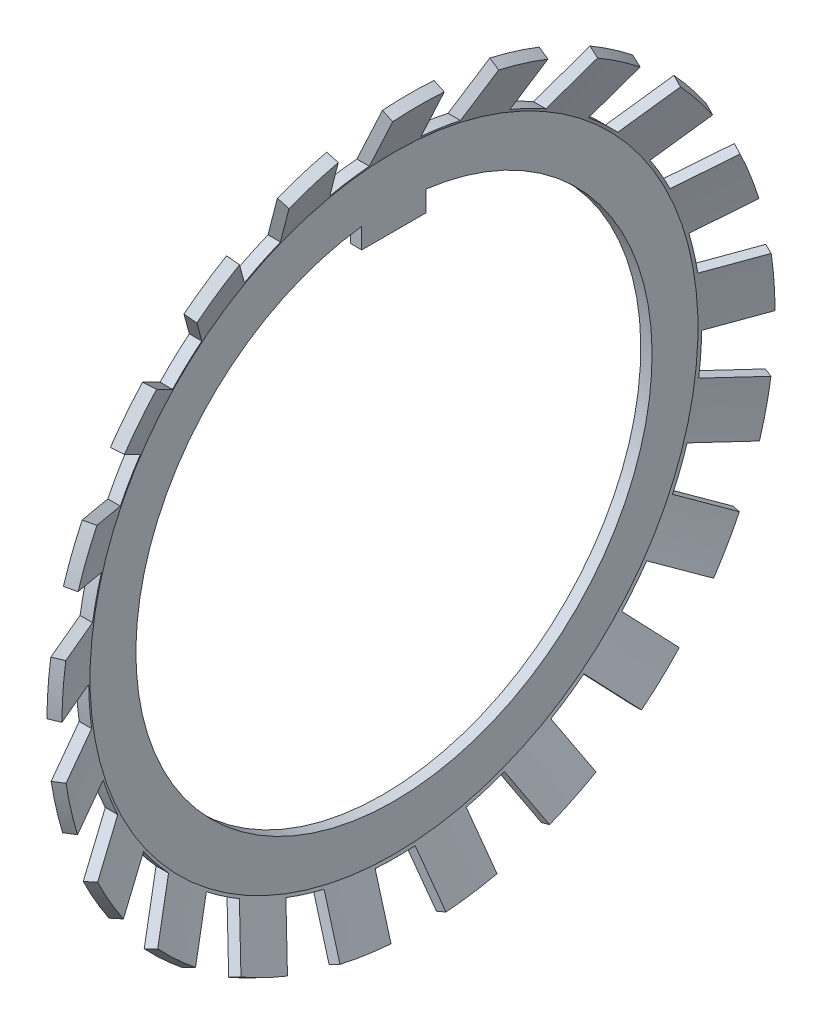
from build123d import *

# Parameters (mm, degrees)
ENL_V_MAT_EXTRU_1_DEPTH = 1.75
ESQUISSE3_W             = 246.4
ESQUISSE3_H             = 246.4
ENL_V_MAT_EXTRU_2_DEPTH = 76.5


with BuildPart() as part:
    # Esquisse1 → R_volution1 (revolve)
    with BuildSketch(Plane.XY, mode=Mode.PRIVATE) as r_volution1_sk:
        Polygon((0, 0), (0, 47.5), (3.963615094, 56), (5.549653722, 55.260418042), (1.75, 47.11203434), (1.75, 0), align=None)
    revolve(r_volution1_sk.sketch.rotate(Axis((1.75, 0, 0), (-1, 0, 0)), 180), axis=Axis((1.75, 0, 0), (-1, 0, 0)))

    # Esquisse2 → Enl_v. mat.-Extru.1 (cut)
    with BuildSketch(Plane(origin=(0, 0, 0), x_dir=(0, 0, -1), z_dir=(1, 0, 0))):
        with BuildLine():
            Line((5, 39.686269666), (5, 36.5))
            Line((5, 36.5), (-5, 36.5))
            Line((-5, 36.5), (-5, 39.686269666))
            ThreePointArc((-5, 39.686269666), (0, -40), (5, 39.686269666))
        make_face()
    extrude(amount=ENL_V_MAT_EXTRU_1_DEPTH, mode=Mode.SUBTRACT)

    # Esquisse3 → Enl_v. mat.-Extru.2 (cut)
    with BuildSketch(Plane(origin=(0, 0, 0), x_dir=(0, 0, -1), z_dir=(1, 0, 0))):
        Rectangle(ESQUISSE3_W, ESQUISSE3_H)
        with BuildLine():
            Line((-55.99969316, 0.185380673), (-47.497851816, -0.451744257))
            ThreePointArc((-47.497851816, -0.451744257), (-47.367180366, -3.549679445), (-47.034669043, -6.632488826))
            Line((-47.034669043, -6.632488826), (-55.3465933, -8.529631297))
            ThreePointArc((-55.3465933, -8.529631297), (-54.595963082, -12.461172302), (-53.566425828, -16.329054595))
            Line((-53.566425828, -16.329054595), (-45.254501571, -14.431912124))
            ThreePointArc((-45.254501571, -14.431912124), (-44.216503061, -17.353698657), (-42.990090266, -20.201538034))
            Line((-42.990090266, -20.201538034), (-50.37354649, -24.464378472))
            ThreePointArc((-50.37354649, -24.464378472), (-48.497422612, -28), (-46.37354649, -31.392581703))
            Line((-46.37354649, -31.392581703), (-38.990090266, -27.129741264))
            ThreePointArc((-38.990090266, -27.129741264), (-37.136995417, -29.615765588), (-35.12565331, -31.975591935))
            Line((-35.12565331, -31.975591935), (-40.924589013, -38.22535826))
            ThreePointArc((-40.924589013, -38.22535826), (-38.089673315, -41.050904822), (-35.060174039, -43.666740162))
            Line((-35.060174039, -43.666740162), (-29.261238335, -37.416973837))
            ThreePointArc((-29.261238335, -37.416973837), (-26.757702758, -39.24634178), (-24.140147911, -40.908474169))
            Line((-24.140147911, -40.908474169), (-27.839302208, -48.589847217))
            ThreePointArc((-27.839302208, -48.589847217), (-24.297489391, -50.454256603), (-20.631551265, -52.06091713))
            Line((-20.631551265, -52.06091713), (-16.932396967, -44.379544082))
            ThreePointArc((-16.932396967, -44.379544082), (-14.000870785, -45.389708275), (-11.009684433, -46.20645895))
            Line((-11.009684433, -46.20645895), (-12.280371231, -54.636915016))
            ThreePointArc((-12.280371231, -54.636915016), (-8.346366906, -55.374526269), (-4.369724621, -55.829253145))
            Line((-4.369724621, -55.829253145), (-3.099037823, -47.398797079))
            ThreePointArc((-3.099037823, -47.398797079), (0, -47.5), (3.099037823, -47.398797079))
            Line((3.099037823, -47.398797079), (4.369724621, -55.829253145))
            ThreePointArc((4.369724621, -55.829253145), (8.346366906, -55.374526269), (12.280371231, -54.636915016))
            Line((12.280371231, -54.636915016), (11.009684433, -46.20645895))
            ThreePointArc((11.009684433, -46.20645895), (14.000870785, -45.389708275), (16.932396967, -44.379544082))
            Line((16.932396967, -44.379544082), (20.631551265, -52.06091713))
            ThreePointArc((20.631551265, -52.06091713), (24.297489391, -50.454256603), (27.839302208, -48.589847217))
            Line((27.839302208, -48.589847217), (24.140147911, -40.908474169))
            ThreePointArc((24.140147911, -40.908474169), (26.757702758, -39.24634178), (29.261238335, -37.416973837))
            Line((29.261238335, -37.416973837), (35.060174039, -43.666740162))
            ThreePointArc((35.060174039, -43.666740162), (38.089673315, -41.050904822), (40.924589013, -38.22535826))
            Line((40.924589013, -38.22535826), (35.12565331, -31.975591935))
            ThreePointArc((35.12565331, -31.975591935), (37.136995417, -29.615765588), (38.990090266, -27.129741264))
            Line((38.990090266, -27.129741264), (46.37354649, -31.392581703))
            ThreePointArc((46.37354649, -31.392581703), (48.497422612, -28), (50.37354649, -24.464378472))
            Line((50.37354649, -24.464378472), (42.990090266, -20.201538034))
            ThreePointArc((42.990090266, -20.201538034), (44.216503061, -17.353698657), (45.254501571, -14.431912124))
            Line((45.254501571, -14.431912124), (53.566425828, -16.329054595))
            ThreePointArc((53.566425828, -16.329054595), (54.595963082, -12.461172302), (55.3465933, -8.529631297))
            Line((55.3465933, -8.529631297), (47.034669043, -6.632488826))
            ThreePointArc((47.034669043, -6.632488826), (47.367180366, -3.549679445), (47.497851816, -0.451744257))
            Line((47.497851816, -0.451744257), (55.99969316, 0.185380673))
            ThreePointArc((55.99969316, 0.185380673), (55.843412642, 4.184885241), (55.401852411, 8.16301105))
            Line((55.401852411, 8.16301105), (46.900011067, 7.52588612))
            ThreePointArc((46.900011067, 7.52588612), (46.309075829, 10.569744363), (45.520809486, 13.568563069))
            Line((45.520809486, 13.568563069), (53.457142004, 16.683344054))
            ThreePointArc((53.457142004, 16.683344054), (52.128929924, 20.459097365), (50.534413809, 24.130334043))
            Line((50.534413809, 24.130334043), (42.598081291, 21.015553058))
            ThreePointArc((42.598081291, 21.015553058), (41.13620668, 23.75), (39.499043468, 26.383244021))
            Line((39.499043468, 26.383244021), (46.164689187, 31.698919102))
            ThreePointArc((46.164689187, 31.698919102), (43.782563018, 34.915428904), (41.176770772, 37.953570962))
            Line((41.176770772, 37.953570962), (34.511125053, 32.637895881))
            ThreePointArc((34.511125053, 32.637895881), (32.308205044, 34.819963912), (29.9676141, 36.853657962))
            Line((29.9676141, 36.853657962), (34.770301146, 43.89790608))
            ThreePointArc((34.770301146, 43.89790608), (31.545923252, 46.269371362), (28.160390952, 48.404466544))
            Line((28.160390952, 48.404466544), (23.357703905, 41.360218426))
            ThreePointArc((23.357703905, 41.360218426), (20.609477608, 42.796021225), (17.773430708, 44.049462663))
            Line((17.773430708, 44.049462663), (20.286419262, 52.19637146))
            ThreePointArc((20.286419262, 52.19637146), (16.506289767, 53.512077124), (12.641836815, 54.554412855))
            Line((12.641836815, 54.554412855), (10.128848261, 46.407504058))
            ThreePointArc((10.128848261, 46.407504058), (7.079507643, 46.969464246), (4, 47.331279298))
            Line((4, 47.331279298), (4, 55.856960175))
            ThreePointArc((4, 55.856960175), (0, 56), (-4, 55.856960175))
            Line((-4, 55.856960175), (-4, 47.331279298))
            ThreePointArc((-4, 47.331279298), (-7.079507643, 46.969464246), (-10.128848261, 46.407504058))
            Line((-10.128848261, 46.407504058), (-12.641836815, 54.554412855))
            ThreePointArc((-12.641836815, 54.554412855), (-16.506289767, 53.512077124), (-20.286419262, 52.19637146))
            Line((-20.286419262, 52.19637146), (-17.773430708, 44.049462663))
            ThreePointArc((-17.773430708, 44.049462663), (-20.609477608, 42.796021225), (-23.357703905, 41.360218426))
            Line((-23.357703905, 41.360218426), (-28.160390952, 48.404466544))
            ThreePointArc((-28.160390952, 48.404466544), (-31.545923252, 46.269371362), (-34.770301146, 43.89790608))
            Line((-34.770301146, 43.89790608), (-29.9676141, 36.853657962))
            ThreePointArc((-29.9676141, 36.853657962), (-32.308205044, 34.819963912), (-34.511125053, 32.637895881))
            Line((-34.511125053, 32.637895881), (-41.176770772, 37.953570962))
            ThreePointArc((-41.176770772, 37.953570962), (-43.782563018, 34.915428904), (-46.164689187, 31.698919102))
            Line((-46.164689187, 31.698919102), (-39.499043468, 26.383244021))
            ThreePointArc((-39.499043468, 26.383244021), (-41.13620668, 23.75), (-42.598081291, 21.015553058))
            Line((-42.598081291, 21.015553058), (-50.534413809, 24.130334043))
            ThreePointArc((-50.534413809, 24.130334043), (-52.128929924, 20.459097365), (-53.457142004, 16.683344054))
            Line((-53.457142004, 16.683344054), (-45.520809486, 13.568563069))
            ThreePointArc((-45.520809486, 13.568563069), (-46.309075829, 10.569744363), (-46.900011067, 7.52588612))
            Line((-46.900011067, 7.52588612), (-55.401852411, 8.16301105))
            ThreePointArc((-55.401852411, 8.16301105), (-55.843412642, 4.184885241), (-55.99969316, 0.185380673))
        make_face(mode=Mode.SUBTRACT)
    extrude(amount=ENL_V_MAT_EXTRU_2_DEPTH, mode=Mode.SUBTRACT)


solid = part.part
